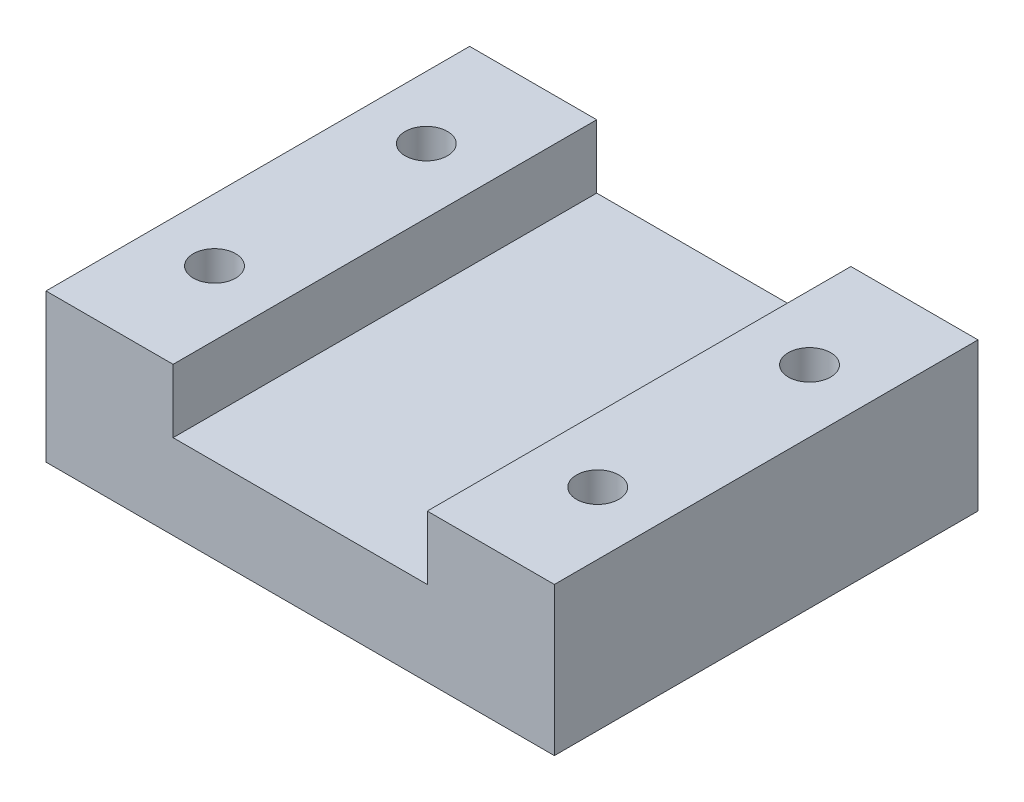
from build123d import *

# Parameters (mm, degrees)
EXTRUDE1_DEPTH     = 63.5
HOLE_SKETCH_R      = 6.35
CUT_EXTRUDE2_DEPTH = 109.694491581


with BuildPart() as part:
    # Base Sketch → Extrude1 (new, symmetric)
    with BuildSketch(Plane.XY):
        Polygon((-76.2, 0), (76.2, 0), (76.2, 44.45), (38.1, 44.45), (38.1, 25.4), (-38.1, 25.4), (-38.1, 44.45), (-76.2, 44.45), align=None)
    extrude(amount=EXTRUDE1_DEPTH, both=True)

    # Hole Sketch → Cut-Extrude2 (cut, through all)
    with BuildSketch(Plane(origin=(0, 44.45, 0), x_dir=(-1, 0, 0), z_dir=(0, 1, 0))):
        with Locations((57.439458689, 31.75)):
            Circle(HOLE_SKETCH_R)
        with Locations((57.439458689, -31.75)):
            Circle(HOLE_SKETCH_R)
    cut_extrude2 = extrude(amount=-CUT_EXTRUDE2_DEPTH, mode=Mode.SUBTRACT)

    # Mirror1: Cut-Extrude2 across plane
    add(cut_extrude2.mirror(Plane(origin=(0, 0, 0), x_dir=(0, 0, 1), z_dir=(1, 0, 0))), mode=Mode.SUBTRACT)


solid = part.part
